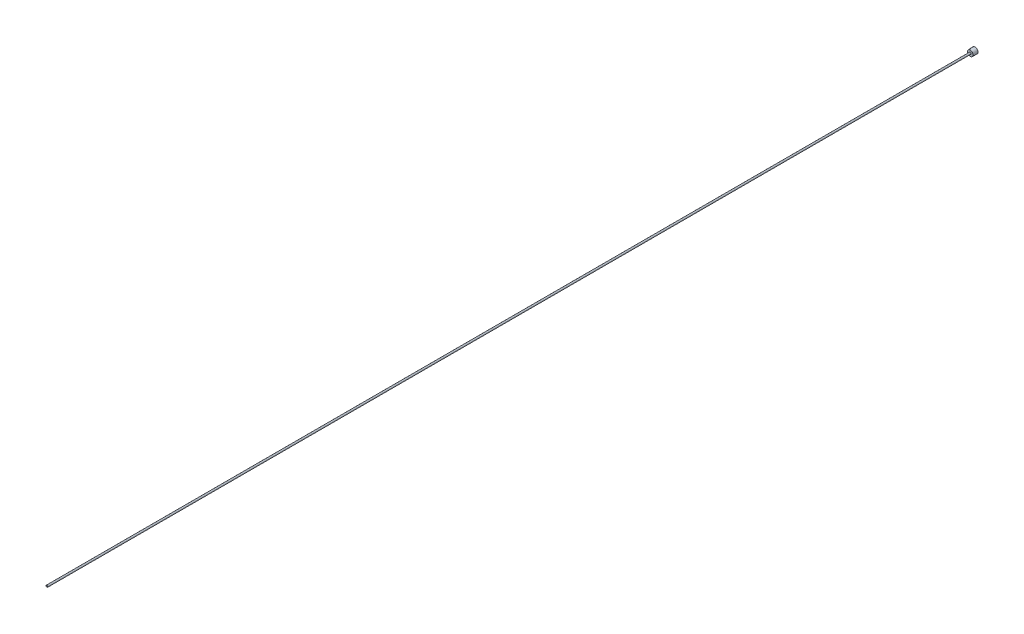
ISO-10303-21;
HEADER;
FILE_DESCRIPTION(('STEP AP214'),'2;1');
FILE_NAME('part.step','',(''),(''),'','','');
FILE_SCHEMA(('AUTOMOTIVE_DESIGN { 1 0 10303 214 1 1 1 1 }'));
ENDSEC;
DATA;
#1=APPLICATION_CONTEXT('core data for automotive mechanical design processes');
#2=APPLICATION_PROTOCOL_DEFINITION('international standard','automotive_design',2000,#1);
#3=PRODUCT_CONTEXT('',#1,'mechanical');
#4=PRODUCT('Part','Part','',(#3));
#5=PRODUCT_RELATED_PRODUCT_CATEGORY('part','',(#4));
#6=PRODUCT_DEFINITION_FORMATION('','',#4);
#7=PRODUCT_DEFINITION_CONTEXT('part definition',#1,'design');
#8=PRODUCT_DEFINITION('design','',#6,#7);
#9=PRODUCT_DEFINITION_SHAPE('','',#8);
#10=(LENGTH_UNIT() NAMED_UNIT(*) SI_UNIT(.MILLI.,.METRE.));
#11=(NAMED_UNIT(*) PLANE_ANGLE_UNIT() SI_UNIT($,.RADIAN.));
#12=(NAMED_UNIT(*) SI_UNIT($,.STERADIAN.) SOLID_ANGLE_UNIT());
#13=UNCERTAINTY_MEASURE_WITH_UNIT(LENGTH_MEASURE(1.E-05),#10,'distance_accuracy_value','');
#14=(GEOMETRIC_REPRESENTATION_CONTEXT(3) GLOBAL_UNCERTAINTY_ASSIGNED_CONTEXT((#13)) GLOBAL_UNIT_ASSIGNED_CONTEXT((#10,
#11,#12)) REPRESENTATION_CONTEXT('',''));
#15=CARTESIAN_POINT('',(0.,0.,0.));
#16=DIRECTION('',(0.,0.,1.));
#17=DIRECTION('',(1.,0.,0.));
#18=AXIS2_PLACEMENT_3D('',#15,#16,#17);
#19=CARTESIAN_POINT('',(0.,0.,0.));
#20=DIRECTION('',(0.,0.,1.));
#21=DIRECTION('',(1.,0.,0.));
#22=AXIS2_PLACEMENT_3D('',#19,#20,#21);
#23=CYLINDRICAL_SURFACE('',#22,0.9652);
#24=CARTESIAN_POINT('',(0.,0.,1219.2));
#25=DIRECTION('',(0.,0.,1.));
#26=DIRECTION('',(1.,0.,0.));
#27=AXIS2_PLACEMENT_3D('',#24,#25,#26);
#28=CIRCLE('',#27,0.9652);
#29=CARTESIAN_POINT('',(0.9652,0.,1219.2));
#30=VERTEX_POINT('',#29);
#31=EDGE_CURVE('E142',#30,#30,#28,.T.);
#32=CARTESIAN_POINT('',(0.,0.,3.96875));
#33=DIRECTION('',(0.,0.,-1.));
#34=DIRECTION('',(-1.,0.,0.));
#35=AXIS2_PLACEMENT_3D('',#32,#33,#34);
#36=CIRCLE('',#35,0.9652);
#37=CARTESIAN_POINT('',(0.9652,0.,3.96875));
#38=VERTEX_POINT('',#37);
#39=EDGE_CURVE('E37',#38,#38,#36,.F.);
#40=CARTESIAN_POINT('',(0.9652,0.,1219.2));
#41=CARTESIAN_POINT('',(0.9652,0.,1206.54134114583));
#42=CARTESIAN_POINT('',(0.9652,0.,1193.88268229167));
#43=CARTESIAN_POINT('',(0.9652,0.,1168.56536458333));
#44=CARTESIAN_POINT('',(0.9652,0.,1155.90670572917));
#45=CARTESIAN_POINT('',(0.9652,0.,1130.58938802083));
#46=CARTESIAN_POINT('',(0.9652,0.,1117.93072916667));
#47=CARTESIAN_POINT('',(0.9652,0.,1092.61341145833));
#48=CARTESIAN_POINT('',(0.9652,0.,1079.95475260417));
#49=CARTESIAN_POINT('',(0.9652,0.,1054.63743489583));
#50=CARTESIAN_POINT('',(0.9652,0.,1041.97877604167));
#51=CARTESIAN_POINT('',(0.9652,0.,1016.66145833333));
#52=CARTESIAN_POINT('',(0.9652,0.,1004.00279947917));
#53=CARTESIAN_POINT('',(0.9652,0.,978.685481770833));
#54=CARTESIAN_POINT('',(0.9652,0.,966.026822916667));
#55=CARTESIAN_POINT('',(0.9652,0.,940.709505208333));
#56=CARTESIAN_POINT('',(0.9652,0.,928.050846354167));
#57=CARTESIAN_POINT('',(0.9652,0.,902.733528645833));
#58=CARTESIAN_POINT('',(0.9652,0.,890.074869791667));
#59=CARTESIAN_POINT('',(0.9652,0.,864.757552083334));
#60=CARTESIAN_POINT('',(0.9652,0.,852.098893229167));
#61=CARTESIAN_POINT('',(0.9652,0.,826.781575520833));
#62=CARTESIAN_POINT('',(0.9652,0.,814.122916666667));
#63=CARTESIAN_POINT('',(0.9652,0.,788.805598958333));
#64=CARTESIAN_POINT('',(0.9652,0.,776.146940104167));
#65=CARTESIAN_POINT('',(0.9652,0.,750.829622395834));
#66=CARTESIAN_POINT('',(0.9652,0.,738.170963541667));
#67=CARTESIAN_POINT('',(0.9652,0.,712.853645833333));
#68=CARTESIAN_POINT('',(0.9652,0.,700.194986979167));
#69=CARTESIAN_POINT('',(0.9652,0.,674.877669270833));
#70=CARTESIAN_POINT('',(0.9652,0.,662.219010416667));
#71=CARTESIAN_POINT('',(0.9652,0.,636.901692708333));
#72=CARTESIAN_POINT('',(0.9652,0.,624.243033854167));
#73=CARTESIAN_POINT('',(0.9652,0.,598.925716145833));
#74=CARTESIAN_POINT('',(0.9652,0.,586.267057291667));
#75=CARTESIAN_POINT('',(0.9652,0.,560.949739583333));
#76=CARTESIAN_POINT('',(0.9652,0.,548.291080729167));
#77=CARTESIAN_POINT('',(0.9652,0.,522.973763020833));
#78=CARTESIAN_POINT('',(0.9652,0.,510.315104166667));
#79=CARTESIAN_POINT('',(0.9652,0.,484.997786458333));
#80=CARTESIAN_POINT('',(0.9652,0.,472.339127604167));
#81=CARTESIAN_POINT('',(0.9652,0.,447.021809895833));
#82=CARTESIAN_POINT('',(0.9652,0.,434.363151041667));
#83=CARTESIAN_POINT('',(0.9652,0.,409.045833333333));
#84=CARTESIAN_POINT('',(0.9652,0.,396.387174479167));
#85=CARTESIAN_POINT('',(0.9652,0.,371.069856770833));
#86=CARTESIAN_POINT('',(0.9652,0.,358.411197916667));
#87=CARTESIAN_POINT('',(0.9652,0.,333.093880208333));
#88=CARTESIAN_POINT('',(0.9652,0.,320.435221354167));
#89=CARTESIAN_POINT('',(0.9652,0.,295.117903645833));
#90=CARTESIAN_POINT('',(0.9652,0.,282.459244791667));
#91=CARTESIAN_POINT('',(0.9652,0.,257.141927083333));
#92=CARTESIAN_POINT('',(0.9652,0.,244.483268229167));
#93=CARTESIAN_POINT('',(0.9652,0.,219.165950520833));
#94=CARTESIAN_POINT('',(0.9652,0.,206.507291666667));
#95=CARTESIAN_POINT('',(0.9652,0.,181.189973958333));
#96=CARTESIAN_POINT('',(0.9652,0.,168.531315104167));
#97=CARTESIAN_POINT('',(0.9652,0.,143.213997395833));
#98=CARTESIAN_POINT('',(0.9652,0.,130.555338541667));
#99=CARTESIAN_POINT('',(0.9652,0.,105.238020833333));
#100=CARTESIAN_POINT('',(0.9652,0.,92.5793619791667));
#101=CARTESIAN_POINT('',(0.9652,0.,67.2620442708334));
#102=CARTESIAN_POINT('',(0.9652,0.,54.6033854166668));
#103=CARTESIAN_POINT('',(0.9652,0.,29.2860677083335));
#104=CARTESIAN_POINT('',(0.9652,0.,16.6274088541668));
#105=CARTESIAN_POINT('',(0.9652,0.,3.96875000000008));
#106=B_SPLINE_CURVE_WITH_KNOTS('',3,(#40,#41,#42,#43,#44,#45,#46,#47,#48,#49,#50,#51,#52,#53,
#54,#55,#56,#57,#58,#59,#60,#61,#62,#63,#64,#65,#66,#67,#68,#69,#70,#71,#72,#73,#74,#75,#76,#77,
#78,#79,#80,#81,#82,#83,#84,#85,#86,#87,#88,#89,#90,#91,#92,#93,#94,#95,#96,#97,#98,#99,#100,
#101,#102,#103,#104,#105),.UNSPECIFIED.,.F.,.F.,(4,2,2,2,2,2,2,2,2,2,2,2,2,2,2,2,2,2,2,2,2,2,2,
2,2,2,2,2,2,2,2,2,4),(0.,37.9759765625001,75.9519531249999,113.9279296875,151.90390625,
189.8798828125,227.855859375,265.8318359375,303.8078125,341.7837890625,379.759765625,
417.7357421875,455.71171875,493.6876953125,531.663671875,569.6396484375,607.615625,
645.5916015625,683.567578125,721.5435546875,759.51953125,797.4955078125,835.471484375,
873.4474609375,911.4234375,949.3994140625,987.375390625,1025.3513671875,1063.32734375,
1101.3033203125,1139.279296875,1177.2552734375,1215.23125),.UNSPECIFIED.);
#107=EDGE_CURVE('BSEAM33',#30,#38,#106,.T.);
#108=ORIENTED_EDGE('',*,*,#31,.T.);
#109=ORIENTED_EDGE('',*,*,#39,.F.);
#110=ORIENTED_EDGE('',*,*,#107,.T.);
#111=ORIENTED_EDGE('',*,*,#107,.F.);
#112=EDGE_LOOP('',(#108,#110,#109,#111));
#113=FACE_BOUND('',#112,.T.);
#114=ADVANCED_FACE('F33',(#113),#23,.F.);
#115=CARTESIAN_POINT('',(0.,0.,0.));
#116=DIRECTION('',(0.,0.,1.));
#117=DIRECTION('',(1.,0.,0.));
#118=AXIS2_PLACEMENT_3D('',#115,#116,#117);
#119=PLANE('',#118);
#120=DIRECTION('',(0.,1.,0.));
#121=VECTOR('',#120,1.);
#122=CARTESIAN_POINT('',(-2.38125,-1.3748153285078,0.));
#123=LINE('',#122,#121);
#124=CARTESIAN_POINT('',(-2.38125,-1.3748153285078,0.));
#125=VERTEX_POINT('',#124);
#126=CARTESIAN_POINT('',(-2.38125,1.3748153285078,0.));
#127=VERTEX_POINT('',#126);
#128=EDGE_CURVE('E124',#125,#127,#123,.T.);
#129=ORIENTED_EDGE('',*,*,#128,.F.);
#130=DIRECTION('',(-0.866025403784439,0.5,0.));
#131=VECTOR('',#130,1.);
#132=CARTESIAN_POINT('',(0.,-2.74963065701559,0.));
#133=LINE('',#132,#131);
#134=CARTESIAN_POINT('',(0.,-2.74963065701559,0.));
#135=VERTEX_POINT('',#134);
#136=EDGE_CURVE('E49',#135,#125,#133,.T.);
#137=ORIENTED_EDGE('',*,*,#136,.F.);
#138=DIRECTION('',(-0.866025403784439,-0.5,0.));
#139=VECTOR('',#138,1.);
#140=CARTESIAN_POINT('',(2.38125,-1.3748153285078,0.));
#141=LINE('',#140,#139);
#142=CARTESIAN_POINT('',(2.38125,-1.3748153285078,0.));
#143=VERTEX_POINT('',#142);
#144=EDGE_CURVE('E133',#143,#135,#141,.T.);
#145=ORIENTED_EDGE('',*,*,#144,.F.);
#146=DIRECTION('',(0.,-1.,0.));
#147=VECTOR('',#146,1.);
#148=CARTESIAN_POINT('',(2.38125,1.3748153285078,0.));
#149=LINE('',#148,#147);
#150=CARTESIAN_POINT('',(2.38125,1.3748153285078,0.));
#151=VERTEX_POINT('',#150);
#152=EDGE_CURVE('E131',#151,#143,#149,.T.);
#153=ORIENTED_EDGE('',*,*,#152,.F.);
#154=DIRECTION('',(0.866025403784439,-0.5,0.));
#155=VECTOR('',#154,1.);
#156=CARTESIAN_POINT('',(0.,2.74963065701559,0.));
#157=LINE('',#156,#155);
#158=CARTESIAN_POINT('',(0.,2.74963065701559,0.));
#159=VERTEX_POINT('',#158);
#160=EDGE_CURVE('E97',#159,#151,#157,.T.);
#161=ORIENTED_EDGE('',*,*,#160,.F.);
#162=DIRECTION('',(0.866025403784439,0.5,0.));
#163=VECTOR('',#162,1.);
#164=CARTESIAN_POINT('',(-2.38125,1.3748153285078,0.));
#165=LINE('',#164,#163);
#166=EDGE_CURVE('E127',#127,#159,#165,.T.);
#167=ORIENTED_EDGE('',*,*,#166,.F.);
#168=EDGE_LOOP('',(#129,#137,#145,#153,#161,#167));
#169=FACE_BOUND('',#168,.T.);
#170=CARTESIAN_POINT('',(0.,0.,0.));
#171=DIRECTION('',(0.,0.,1.));
#172=DIRECTION('',(1.,0.,0.));
#173=AXIS2_PLACEMENT_3D('',#170,#171,#172);
#174=CIRCLE('',#173,3.8989);
#175=CARTESIAN_POINT('',(3.8989,0.,0.));
#176=VERTEX_POINT('',#175);
#177=EDGE_CURVE('E11',#176,#176,#174,.T.);
#178=ORIENTED_EDGE('',*,*,#177,.F.);
#179=EDGE_LOOP('',(#178));
#180=FACE_BOUND('',#179,.T.);
#181=ADVANCED_FACE('F35',(#169,#180),#119,.F.);
#182=CARTESIAN_POINT('',(0.,0.,0.));
#183=DIRECTION('',(0.,0.,-1.));
#184=DIRECTION('',(-1.,0.,0.));
#185=AXIS2_PLACEMENT_3D('',#182,#183,#184);
#186=CONICAL_SURFACE('',#185,3.8989,0.0364424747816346);
#187=CARTESIAN_POINT('',(0.,0.,6.35));
#188=DIRECTION('',(0.,0.,1.));
#189=DIRECTION('',(1.,0.,0.));
#190=AXIS2_PLACEMENT_3D('',#187,#188,#189);
#191=CIRCLE('',#190,3.66738778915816);
#192=CARTESIAN_POINT('',(3.66738778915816,0.,6.35));
#193=VERTEX_POINT('',#192);
#194=EDGE_CURVE('E42',#193,#193,#191,.T.);
#195=ORIENTED_EDGE('',*,*,#194,.F.);
#196=EDGE_LOOP('',(#195));
#197=FACE_BOUND('',#196,.T.);
#198=ORIENTED_EDGE('',*,*,#177,.T.);
#199=EDGE_LOOP('',(#198));
#200=FACE_BOUND('',#199,.T.);
#201=ADVANCED_FACE('F156',(#197,#200),#186,.T.);
#202=CARTESIAN_POINT('',(0.,3.66738778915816,6.35));
#203=DIRECTION('',(0.,0.,-1.));
#204=DIRECTION('',(-1.,0.,0.));
#205=AXIS2_PLACEMENT_3D('',#202,#203,#204);
#206=PLANE('',#205);
#207=CARTESIAN_POINT('',(0.,0.,6.35));
#208=DIRECTION('',(0.,0.,1.));
#209=DIRECTION('',(1.,0.,0.));
#210=AXIS2_PLACEMENT_3D('',#207,#208,#209);
#211=CIRCLE('',#210,1.143);
#212=CARTESIAN_POINT('',(1.143,0.,6.35));
#213=VERTEX_POINT('',#212);
#214=EDGE_CURVE('E148',#213,#213,#211,.T.);
#215=ORIENTED_EDGE('',*,*,#214,.F.);
#216=EDGE_LOOP('',(#215));
#217=FACE_BOUND('',#216,.T.);
#218=ORIENTED_EDGE('',*,*,#194,.T.);
#219=EDGE_LOOP('',(#218));
#220=FACE_BOUND('',#219,.T.);
#221=ADVANCED_FACE('F154',(#217,#220),#206,.F.);
#222=CARTESIAN_POINT('',(0.,0.,0.));
#223=DIRECTION('',(0.,0.,1.));
#224=DIRECTION('',(1.,0.,0.));
#225=AXIS2_PLACEMENT_3D('',#222,#223,#224);
#226=CYLINDRICAL_SURFACE('',#225,1.14299999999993);
#227=CARTESIAN_POINT('',(0.,0.,1219.2));
#228=DIRECTION('',(0.,0.,1.));
#229=DIRECTION('',(1.,0.,0.));
#230=AXIS2_PLACEMENT_3D('',#227,#228,#229);
#231=CIRCLE('',#230,1.14299999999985);
#232=CARTESIAN_POINT('',(1.14299999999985,0.,1219.2));
#233=VERTEX_POINT('',#232);
#234=EDGE_CURVE('E145',#233,#233,#231,.T.);
#235=ORIENTED_EDGE('',*,*,#234,.F.);
#236=EDGE_LOOP('',(#235));
#237=FACE_BOUND('',#236,.T.);
#238=ORIENTED_EDGE('',*,*,#214,.T.);
#239=EDGE_LOOP('',(#238));
#240=FACE_BOUND('',#239,.T.);
#241=ADVANCED_FACE('F190',(#237,#240),#226,.T.);
#242=CARTESIAN_POINT('',(0.,1.14299999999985,1219.2));
#243=DIRECTION('',(0.,0.,-1.));
#244=DIRECTION('',(-1.,0.,0.));
#245=AXIS2_PLACEMENT_3D('',#242,#243,#244);
#246=PLANE('',#245);
#247=ORIENTED_EDGE('',*,*,#31,.F.);
#248=EDGE_LOOP('',(#247));
#249=FACE_BOUND('',#248,.T.);
#250=ORIENTED_EDGE('',*,*,#234,.T.);
#251=EDGE_LOOP('',(#250));
#252=FACE_BOUND('',#251,.T.);
#253=ADVANCED_FACE('F183',(#249,#252),#246,.F.);
#254=CARTESIAN_POINT('',(-2.38125,-1.3748153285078,3.96875));
#255=DIRECTION('',(0.,0.,-1.));
#256=DIRECTION('',(-1.,0.,0.));
#257=AXIS2_PLACEMENT_3D('',#254,#255,#256);
#258=PLANE('',#257);
#259=DIRECTION('',(-0.866025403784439,0.5,0.));
#260=VECTOR('',#259,1.);
#261=CARTESIAN_POINT('',(0.,-2.74963065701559,3.96875));
#262=LINE('',#261,#260);
#263=CARTESIAN_POINT('',(0.,-2.74963065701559,3.96875));
#264=VERTEX_POINT('',#263);
#265=CARTESIAN_POINT('',(-2.38125,-1.3748153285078,3.96875));
#266=VERTEX_POINT('',#265);
#267=EDGE_CURVE('E135',#264,#266,#262,.T.);
#268=ORIENTED_EDGE('',*,*,#267,.T.);
#269=DIRECTION('',(0.,1.,0.));
#270=VECTOR('',#269,1.);
#271=CARTESIAN_POINT('',(-2.38125,-1.3748153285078,3.96875));
#272=LINE('',#271,#270);
#273=CARTESIAN_POINT('',(-2.38125,1.3748153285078,3.96875));
#274=VERTEX_POINT('',#273);
#275=EDGE_CURVE('E118',#266,#274,#272,.T.);
#276=ORIENTED_EDGE('',*,*,#275,.T.);
#277=DIRECTION('',(0.866025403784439,0.5,0.));
#278=VECTOR('',#277,1.);
#279=CARTESIAN_POINT('',(-2.38125,1.3748153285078,3.96875));
#280=LINE('',#279,#278);
#281=CARTESIAN_POINT('',(0.,2.74963065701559,3.96875));
#282=VERTEX_POINT('',#281);
#283=EDGE_CURVE('E116',#274,#282,#280,.T.);
#284=ORIENTED_EDGE('',*,*,#283,.T.);
#285=DIRECTION('',(0.866025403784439,-0.5,0.));
#286=VECTOR('',#285,1.);
#287=CARTESIAN_POINT('',(0.,2.74963065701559,3.96875));
#288=LINE('',#287,#286);
#289=CARTESIAN_POINT('',(2.38125,1.3748153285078,3.96875));
#290=VERTEX_POINT('',#289);
#291=EDGE_CURVE('E94',#282,#290,#288,.T.);
#292=ORIENTED_EDGE('',*,*,#291,.T.);
#293=DIRECTION('',(0.,-1.,0.));
#294=VECTOR('',#293,1.);
#295=CARTESIAN_POINT('',(2.38125,1.3748153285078,3.96875));
#296=LINE('',#295,#294);
#297=CARTESIAN_POINT('',(2.38125,-1.3748153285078,3.96875));
#298=VERTEX_POINT('',#297);
#299=EDGE_CURVE('E105',#290,#298,#296,.T.);
#300=ORIENTED_EDGE('',*,*,#299,.T.);
#301=DIRECTION('',(-0.866025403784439,-0.5,0.));
#302=VECTOR('',#301,1.);
#303=CARTESIAN_POINT('',(2.38125,-1.3748153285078,3.96875));
#304=LINE('',#303,#302);
#305=EDGE_CURVE('E109',#298,#264,#304,.T.);
#306=ORIENTED_EDGE('',*,*,#305,.T.);
#307=EDGE_LOOP('',(#268,#276,#284,#292,#300,#306));
#308=FACE_BOUND('',#307,.T.);
#309=ORIENTED_EDGE('',*,*,#39,.T.);
#310=EDGE_LOOP('',(#309));
#311=FACE_BOUND('',#310,.T.);
#312=ADVANCED_FACE('F112',(#308,#311),#258,.T.);
#313=CARTESIAN_POINT('',(0.,-2.74963065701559,3.96875));
#314=DIRECTION('',(-0.5,-0.866025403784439,0.));
#315=DIRECTION('',(0.866025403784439,-0.5,0.));
#316=AXIS2_PLACEMENT_3D('',#313,#314,#315);
#317=PLANE('',#316);
#318=ORIENTED_EDGE('',*,*,#136,.T.);
#319=DIRECTION('',(0.,0.,-1.));
#320=VECTOR('',#319,1.);
#321=CARTESIAN_POINT('',(-2.38125,-1.3748153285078,3.96875));
#322=LINE('',#321,#320);
#323=EDGE_CURVE('E79',#266,#125,#322,.T.);
#324=ORIENTED_EDGE('',*,*,#323,.F.);
#325=ORIENTED_EDGE('',*,*,#267,.F.);
#326=DIRECTION('',(0.,0.,-1.));
#327=VECTOR('',#326,1.);
#328=CARTESIAN_POINT('',(0.,-2.74963065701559,3.96875));
#329=LINE('',#328,#327);
#330=EDGE_CURVE('E57',#264,#135,#329,.T.);
#331=ORIENTED_EDGE('',*,*,#330,.T.);
#332=EDGE_LOOP('',(#318,#324,#325,#331));
#333=FACE_BOUND('',#332,.T.);
#334=ADVANCED_FACE('F174',(#333),#317,.F.);
#335=CARTESIAN_POINT('',(2.38125,-1.3748153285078,3.96875));
#336=DIRECTION('',(0.5,-0.866025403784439,0.));
#337=DIRECTION('',(0.866025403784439,0.5,0.));
#338=AXIS2_PLACEMENT_3D('',#335,#336,#337);
#339=PLANE('',#338);
#340=ORIENTED_EDGE('',*,*,#144,.T.);
#341=ORIENTED_EDGE('',*,*,#330,.F.);
#342=ORIENTED_EDGE('',*,*,#305,.F.);
#343=DIRECTION('',(0.,0.,-1.));
#344=VECTOR('',#343,1.);
#345=CARTESIAN_POINT('',(2.38125,-1.3748153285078,3.96875));
#346=LINE('',#345,#344);
#347=EDGE_CURVE('E101',#298,#143,#346,.T.);
#348=ORIENTED_EDGE('',*,*,#347,.T.);
#349=EDGE_LOOP('',(#340,#341,#342,#348));
#350=FACE_BOUND('',#349,.T.);
#351=ADVANCED_FACE('F176',(#350),#339,.F.);
#352=CARTESIAN_POINT('',(2.38125,1.3748153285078,3.96875));
#353=DIRECTION('',(1.,0.,0.));
#354=DIRECTION('',(0.,1.,0.));
#355=AXIS2_PLACEMENT_3D('',#352,#353,#354);
#356=PLANE('',#355);
#357=ORIENTED_EDGE('',*,*,#152,.T.);
#358=ORIENTED_EDGE('',*,*,#347,.F.);
#359=ORIENTED_EDGE('',*,*,#299,.F.);
#360=DIRECTION('',(0.,0.,-1.));
#361=VECTOR('',#360,1.);
#362=CARTESIAN_POINT('',(2.38125,1.3748153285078,3.96875));
#363=LINE('',#362,#361);
#364=EDGE_CURVE('E90',#290,#151,#363,.T.);
#365=ORIENTED_EDGE('',*,*,#364,.T.);
#366=EDGE_LOOP('',(#357,#358,#359,#365));
#367=FACE_BOUND('',#366,.T.);
#368=ADVANCED_FACE('F106',(#367),#356,.F.);
#369=CARTESIAN_POINT('',(0.,2.74963065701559,3.96875));
#370=DIRECTION('',(0.5,0.866025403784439,0.));
#371=DIRECTION('',(-0.866025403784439,0.5,0.));
#372=AXIS2_PLACEMENT_3D('',#369,#370,#371);
#373=PLANE('',#372);
#374=ORIENTED_EDGE('',*,*,#160,.T.);
#375=ORIENTED_EDGE('',*,*,#364,.F.);
#376=ORIENTED_EDGE('',*,*,#291,.F.);
#377=DIRECTION('',(0.,0.,-1.));
#378=VECTOR('',#377,1.);
#379=CARTESIAN_POINT('',(0.,2.74963065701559,3.96875));
#380=LINE('',#379,#378);
#381=EDGE_CURVE('E102',#282,#159,#380,.T.);
#382=ORIENTED_EDGE('',*,*,#381,.T.);
#383=EDGE_LOOP('',(#374,#375,#376,#382));
#384=FACE_BOUND('',#383,.T.);
#385=ADVANCED_FACE('F92',(#384),#373,.F.);
#386=CARTESIAN_POINT('',(-2.38125,1.3748153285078,3.96875));
#387=DIRECTION('',(-0.5,0.866025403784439,0.));
#388=DIRECTION('',(-0.866025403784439,-0.5,0.));
#389=AXIS2_PLACEMENT_3D('',#386,#387,#388);
#390=PLANE('',#389);
#391=ORIENTED_EDGE('',*,*,#166,.T.);
#392=ORIENTED_EDGE('',*,*,#381,.F.);
#393=ORIENTED_EDGE('',*,*,#283,.F.);
#394=DIRECTION('',(0.,0.,-1.));
#395=VECTOR('',#394,1.);
#396=CARTESIAN_POINT('',(-2.38125,1.3748153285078,3.96875));
#397=LINE('',#396,#395);
#398=EDGE_CURVE('E139',#274,#127,#397,.T.);
#399=ORIENTED_EDGE('',*,*,#398,.T.);
#400=EDGE_LOOP('',(#391,#392,#393,#399));
#401=FACE_BOUND('',#400,.T.);
#402=ADVANCED_FACE('F246',(#401),#390,.F.);
#403=CARTESIAN_POINT('',(-2.38125,-1.3748153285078,3.96875));
#404=DIRECTION('',(-1.,0.,0.));
#405=DIRECTION('',(0.,-1.,0.));
#406=AXIS2_PLACEMENT_3D('',#403,#404,#405);
#407=PLANE('',#406);
#408=ORIENTED_EDGE('',*,*,#128,.T.);
#409=ORIENTED_EDGE('',*,*,#398,.F.);
#410=ORIENTED_EDGE('',*,*,#275,.F.);
#411=ORIENTED_EDGE('',*,*,#323,.T.);
#412=EDGE_LOOP('',(#408,#409,#410,#411));
#413=FACE_BOUND('',#412,.T.);
#414=ADVANCED_FACE('F172',(#413),#407,.F.);
#415=CLOSED_SHELL('',(#114,#181,#201,#221,#241,#253,#312,#334,#351,#368,#385,#402,#414));
#416=MANIFOLD_SOLID_BREP('B2',#415);
#417=ADVANCED_BREP_SHAPE_REPRESENTATION('',(#18,#416),#14);
#418=SHAPE_DEFINITION_REPRESENTATION(#9,#417);
ENDSEC;
END-ISO-10303-21;
